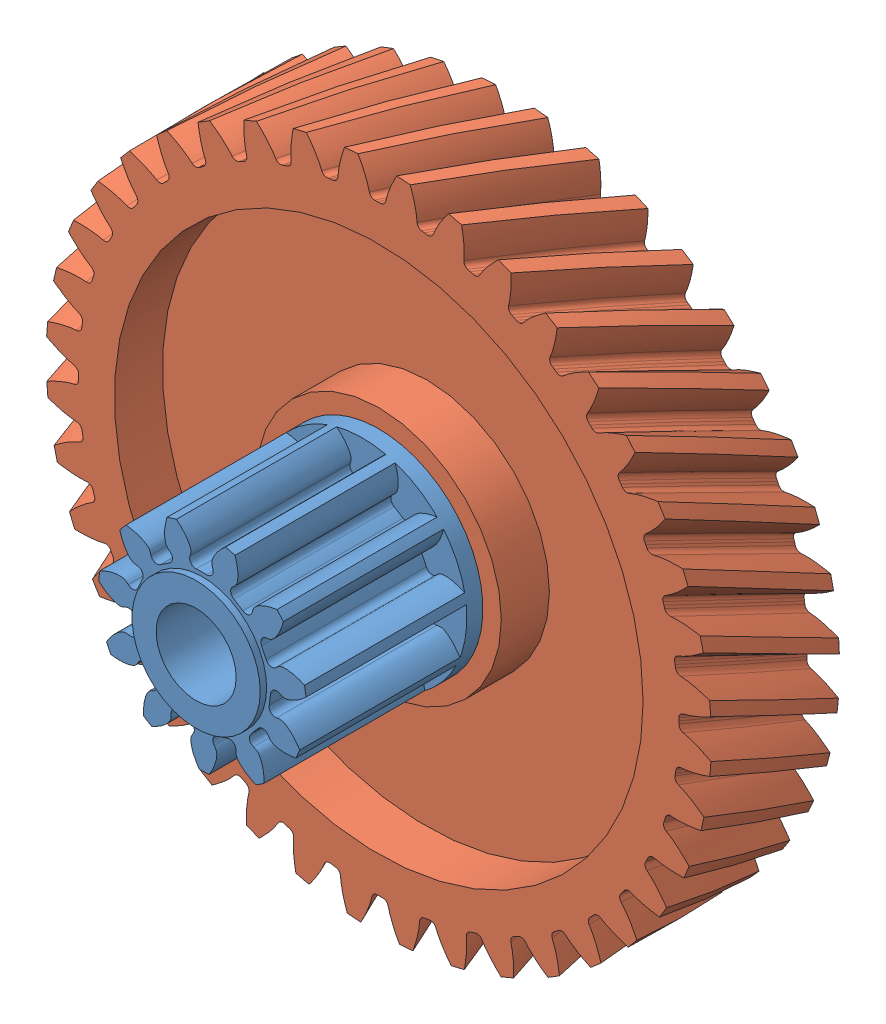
SolidWorks assembly CE10_Roue_2-3.sldasm, configuration Défaut (file format 9000). Lengths in mm.
Overall size (41.57 41.57 22).
3 component instances, 3 part files, 0 mates.
Components (placement in the parent):
- 70_R3-1: 70_R3.sldprt [Défaut] at origin size (13 13 11.4)
- 70_R2-1: 70_R2.sldprt [Défaut] at (0 0 -9) size (41.57 41.57 10.4)
- 70_k_2-1: 70_k_2.sldprt [Défaut] at (0 0 -11.4) x (0.976441 -0.215784 0) z (0 0 -1) size (11 11 0.2)
